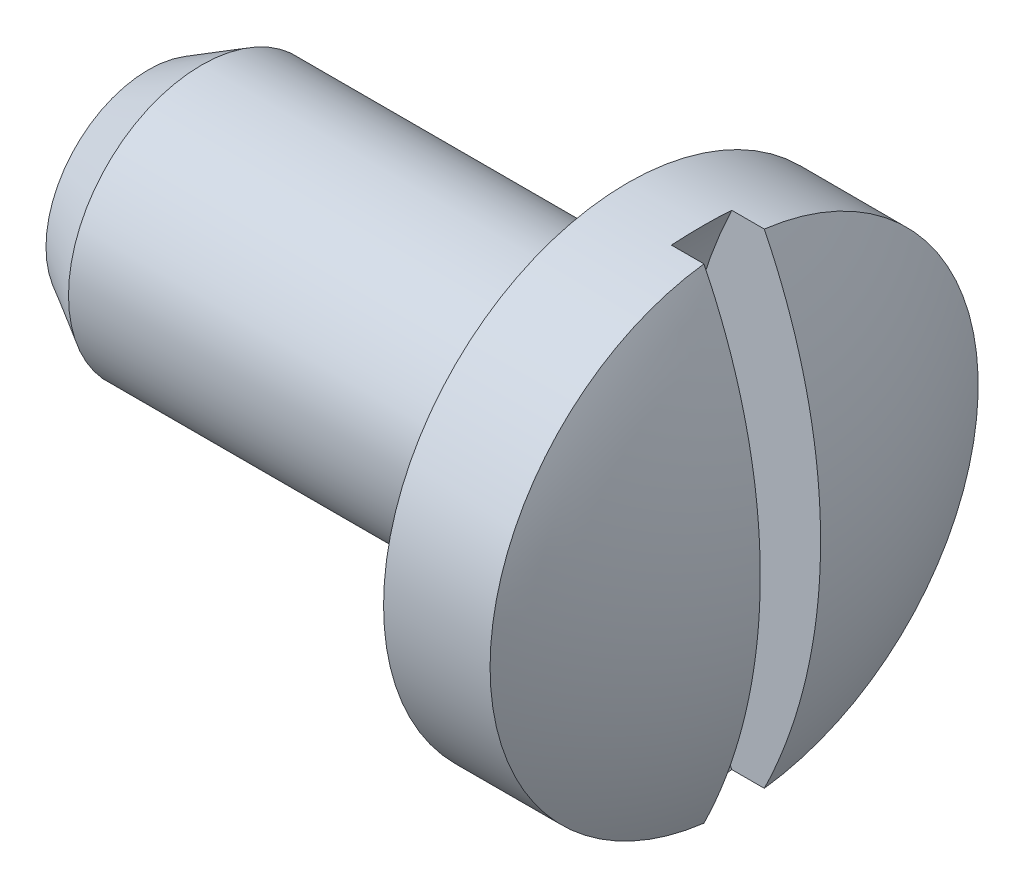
ISO-10303-21;
HEADER;
FILE_DESCRIPTION(('STEP AP214'),'2;1');
FILE_NAME('part.step','',(''),(''),'','','');
FILE_SCHEMA(('AUTOMOTIVE_DESIGN { 1 0 10303 214 1 1 1 1 }'));
ENDSEC;
DATA;
#1=APPLICATION_CONTEXT('core data for automotive mechanical design processes');
#2=APPLICATION_PROTOCOL_DEFINITION('international standard','automotive_design',2000,#1);
#3=PRODUCT_CONTEXT('',#1,'mechanical');
#4=PRODUCT('Part','Part','',(#3));
#5=PRODUCT_RELATED_PRODUCT_CATEGORY('part','',(#4));
#6=PRODUCT_DEFINITION_FORMATION('','',#4);
#7=PRODUCT_DEFINITION_CONTEXT('part definition',#1,'design');
#8=PRODUCT_DEFINITION('design','',#6,#7);
#9=PRODUCT_DEFINITION_SHAPE('','',#8);
#10=(LENGTH_UNIT() NAMED_UNIT(*) SI_UNIT(.MILLI.,.METRE.));
#11=(NAMED_UNIT(*) PLANE_ANGLE_UNIT() SI_UNIT($,.RADIAN.));
#12=(NAMED_UNIT(*) SI_UNIT($,.STERADIAN.) SOLID_ANGLE_UNIT());
#13=UNCERTAINTY_MEASURE_WITH_UNIT(LENGTH_MEASURE(1.E-05),#10,'distance_accuracy_value','');
#14=(GEOMETRIC_REPRESENTATION_CONTEXT(3) GLOBAL_UNCERTAINTY_ASSIGNED_CONTEXT((#13)) GLOBAL_UNIT_ASSIGNED_CONTEXT((#10,
#11,#12)) REPRESENTATION_CONTEXT('',''));
#15=CARTESIAN_POINT('',(0.,0.,0.));
#16=DIRECTION('',(0.,0.,1.));
#17=DIRECTION('',(1.,0.,0.));
#18=AXIS2_PLACEMENT_3D('',#15,#16,#17);
#19=CARTESIAN_POINT('',(0.,0.,0.));
#20=DIRECTION('',(-1.,0.,0.));
#21=DIRECTION('',(0.,0.,1.));
#22=AXIS2_PLACEMENT_3D('',#19,#20,#21);
#23=CYLINDRICAL_SURFACE('',#22,3.4925);
#24=CARTESIAN_POINT('',(6.858,0.,0.));
#25=DIRECTION('',(-1.,0.,0.));
#26=DIRECTION('',(0.,0.,1.));
#27=AXIS2_PLACEMENT_3D('',#24,#25,#26);
#28=CIRCLE('',#27,3.4925);
#29=CARTESIAN_POINT('',(6.858,0.,3.4925));
#30=VERTEX_POINT('',#29);
#31=EDGE_CURVE('E101',#30,#30,#28,.T.);
#32=ORIENTED_EDGE('',*,*,#31,.F.);
#33=EDGE_LOOP('',(#32));
#34=FACE_BOUND('',#33,.T.);
#35=DIRECTION('',(-1.,0.,0.));
#36=VECTOR('',#35,1.);
#37=CARTESIAN_POINT('',(0.,3.46570411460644,-0.4318));
#38=LINE('',#37,#36);
#39=CARTESIAN_POINT('',(8.382,3.46570411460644,-0.4318));
#40=VERTEX_POINT('',#39);
#41=CARTESIAN_POINT('',(7.91613510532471,3.46570411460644,-0.4318));
#42=VERTEX_POINT('',#41);
#43=EDGE_CURVE('E94',#40,#42,#38,.T.);
#44=ORIENTED_EDGE('',*,*,#43,.F.);
#45=CARTESIAN_POINT('',(8.382,0.,0.));
#46=DIRECTION('',(-1.,0.,0.));
#47=DIRECTION('',(0.,0.,1.));
#48=AXIS2_PLACEMENT_3D('',#45,#46,#47);
#49=CIRCLE('',#48,3.4925);
#50=CARTESIAN_POINT('',(8.382,-3.46570411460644,-0.4318));
#51=VERTEX_POINT('',#50);
#52=EDGE_CURVE('E100',#40,#51,#49,.T.);
#53=ORIENTED_EDGE('',*,*,#52,.T.);
#54=DIRECTION('',(-1.,0.,0.));
#55=VECTOR('',#54,1.);
#56=CARTESIAN_POINT('',(0.,-3.46570411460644,-0.4318));
#57=LINE('',#56,#55);
#58=CARTESIAN_POINT('',(7.91613510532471,-3.46570411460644,-0.4318));
#59=VERTEX_POINT('',#58);
#60=EDGE_CURVE('E92',#59,#51,#57,.F.);
#61=ORIENTED_EDGE('',*,*,#60,.F.);
#62=CARTESIAN_POINT('',(7.91613510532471,-3.46570411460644,-0.4318));
#63=CARTESIAN_POINT('',(7.92466112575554,-3.48356803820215,-0.287866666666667));
#64=CARTESIAN_POINT('',(7.92892413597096,-3.4925,-0.143933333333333));
#65=CARTESIAN_POINT('',(7.92892413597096,-3.4925,0.143933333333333));
#66=CARTESIAN_POINT('',(7.92466112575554,-3.48356803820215,0.287866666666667));
#67=CARTESIAN_POINT('',(7.91613510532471,-3.46570411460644,0.4318));
#68=B_SPLINE_CURVE_WITH_KNOTS('',3,(#62,#63,#64,#65,#66,#67),.UNSPECIFIED.,.F.,.F.,(4,2,4),(0.,
0.432819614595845,0.865639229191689),.UNSPECIFIED.);
#69=CARTESIAN_POINT('',(7.91613510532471,-3.46570411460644,0.4318));
#70=VERTEX_POINT('',#69);
#71=EDGE_CURVE('E45',#59,#70,#68,.T.);
#72=ORIENTED_EDGE('',*,*,#71,.T.);
#73=DIRECTION('',(-1.,0.,0.));
#74=VECTOR('',#73,1.);
#75=CARTESIAN_POINT('',(0.,-3.46570411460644,0.4318));
#76=LINE('',#75,#74);
#77=CARTESIAN_POINT('',(8.382,-3.46570411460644,0.4318));
#78=VERTEX_POINT('',#77);
#79=EDGE_CURVE('E87',#70,#78,#76,.F.);
#80=ORIENTED_EDGE('',*,*,#79,.T.);
#81=CARTESIAN_POINT('',(8.382,3.46570411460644,0.4318));
#82=VERTEX_POINT('',#81);
#83=EDGE_CURVE('E91',#78,#82,#49,.T.);
#84=ORIENTED_EDGE('',*,*,#83,.T.);
#85=DIRECTION('',(-1.,0.,0.));
#86=VECTOR('',#85,1.);
#87=CARTESIAN_POINT('',(0.,3.46570411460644,0.4318));
#88=LINE('',#87,#86);
#89=CARTESIAN_POINT('',(7.91613510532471,3.46570411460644,0.4318));
#90=VERTEX_POINT('',#89);
#91=EDGE_CURVE('E52',#82,#90,#88,.T.);
#92=ORIENTED_EDGE('',*,*,#91,.T.);
#93=CARTESIAN_POINT('',(7.91613510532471,3.46570411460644,0.4318));
#94=CARTESIAN_POINT('',(7.92466112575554,3.48356803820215,0.287866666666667));
#95=CARTESIAN_POINT('',(7.92892413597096,3.4925,0.143933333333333));
#96=CARTESIAN_POINT('',(7.92892413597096,3.4925,-0.143933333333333));
#97=CARTESIAN_POINT('',(7.92466112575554,3.48356803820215,-0.287866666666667));
#98=CARTESIAN_POINT('',(7.91613510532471,3.46570411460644,-0.4318));
#99=B_SPLINE_CURVE_WITH_KNOTS('',3,(#93,#94,#95,#96,#97,#98),.UNSPECIFIED.,.F.,.F.,(4,2,4),(0.,
0.432819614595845,0.865639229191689),.UNSPECIFIED.);
#100=EDGE_CURVE('E11',#90,#42,#99,.T.);
#101=ORIENTED_EDGE('',*,*,#100,.T.);
#102=EDGE_LOOP('',(#44,#53,#61,#72,#80,#84,#92,#101));
#103=FACE_BOUND('',#102,.T.);
#104=ADVANCED_FACE('F32',(#34,#103),#23,.T.);
#105=CARTESIAN_POINT('',(1.32492413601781,0.,0.));
#106=DIRECTION('',(-1.,0.,0.));
#107=DIRECTION('',(0.,1.,0.));
#108=AXIS2_PLACEMENT_3D('',#105,#106,#107);
#109=SPHERICAL_SURFACE('',#108,7.874);
#110=CARTESIAN_POINT('',(1.32492413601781,0.,-0.4318));
#111=DIRECTION('',(0.,0.,1.));
#112=DIRECTION('',(1.,0.,0.));
#113=AXIS2_PLACEMENT_3D('',#110,#111,#112);
#114=CIRCLE('',#113,7.86215140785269);
#115=EDGE_CURVE('E60',#51,#40,#114,.T.);
#116=ORIENTED_EDGE('',*,*,#115,.F.);
#117=ORIENTED_EDGE('',*,*,#52,.F.);
#118=EDGE_LOOP('',(#116,#117));
#119=FACE_BOUND('',#118,.T.);
#120=ADVANCED_FACE('F134',(#119),#109,.T.);
#121=CARTESIAN_POINT('',(0.,0.,0.));
#122=DIRECTION('',(1.,0.,0.));
#123=DIRECTION('',(0.,0.,-1.));
#124=AXIS2_PLACEMENT_3D('',#121,#122,#123);
#125=PLANE('',#124);
#126=CARTESIAN_POINT('',(0.,0.,0.));
#127=DIRECTION('',(-1.,0.,0.));
#128=DIRECTION('',(0.,0.,1.));
#129=AXIS2_PLACEMENT_3D('',#126,#127,#128);
#130=CIRCLE('',#129,1.4650590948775);
#131=CARTESIAN_POINT('',(0.,0.,1.4650590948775));
#132=VERTEX_POINT('',#131);
#133=EDGE_CURVE('E113',#132,#132,#130,.T.);
#134=ORIENTED_EDGE('',*,*,#133,.T.);
#135=EDGE_LOOP('',(#134));
#136=FACE_BOUND('',#135,.T.);
#137=ADVANCED_FACE('F34',(#136),#125,.F.);
#138=CARTESIAN_POINT('',(0.762,0.,0.));
#139=DIRECTION('',(1.,0.,0.));
#140=DIRECTION('',(0.,0.,-1.));
#141=AXIS2_PLACEMENT_3D('',#138,#139,#140);
#142=CONICAL_SURFACE('',#141,1.905,0.5235987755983);
#143=ORIENTED_EDGE('',*,*,#133,.F.);
#144=EDGE_LOOP('',(#143));
#145=FACE_BOUND('',#144,.T.);
#146=CARTESIAN_POINT('',(0.762,0.,0.));
#147=DIRECTION('',(-1.,0.,0.));
#148=DIRECTION('',(0.,0.,1.));
#149=AXIS2_PLACEMENT_3D('',#146,#147,#148);
#150=CIRCLE('',#149,1.905);
#151=CARTESIAN_POINT('',(0.762,0.,1.905));
#152=VERTEX_POINT('',#151);
#153=EDGE_CURVE('E110',#152,#152,#150,.T.);
#154=ORIENTED_EDGE('',*,*,#153,.T.);
#155=EDGE_LOOP('',(#154));
#156=FACE_BOUND('',#155,.T.);
#157=ADVANCED_FACE('F159',(#145,#156),#142,.T.);
#158=CARTESIAN_POINT('',(0.,0.,0.));
#159=DIRECTION('',(-1.,0.,0.));
#160=DIRECTION('',(0.,0.,1.));
#161=AXIS2_PLACEMENT_3D('',#158,#159,#160);
#162=CYLINDRICAL_SURFACE('',#161,1.905);
#163=ORIENTED_EDGE('',*,*,#153,.F.);
#164=EDGE_LOOP('',(#163));
#165=FACE_BOUND('',#164,.T.);
#166=CARTESIAN_POINT('',(6.604,0.,0.));
#167=DIRECTION('',(-1.,0.,0.));
#168=DIRECTION('',(0.,0.,1.));
#169=AXIS2_PLACEMENT_3D('',#166,#167,#168);
#170=CIRCLE('',#169,1.905);
#171=CARTESIAN_POINT('',(6.604,0.,1.905));
#172=VERTEX_POINT('',#171);
#173=EDGE_CURVE('E107',#172,#172,#170,.T.);
#174=ORIENTED_EDGE('',*,*,#173,.T.);
#175=EDGE_LOOP('',(#174));
#176=FACE_BOUND('',#175,.T.);
#177=ADVANCED_FACE('F166',(#165,#176),#162,.T.);
#178=CARTESIAN_POINT('',(6.604,0.,0.));
#179=DIRECTION('',(-1.,0.,0.));
#180=DIRECTION('',(0.,0.,1.));
#181=AXIS2_PLACEMENT_3D('',#178,#179,#180);
#182=TOROIDAL_SURFACE('',#181,2.159,0.254);
#183=ORIENTED_EDGE('',*,*,#173,.F.);
#184=EDGE_LOOP('',(#183));
#185=FACE_BOUND('',#184,.T.);
#186=CARTESIAN_POINT('',(6.858,0.,0.));
#187=DIRECTION('',(-1.,0.,0.));
#188=DIRECTION('',(0.,0.,1.));
#189=AXIS2_PLACEMENT_3D('',#186,#187,#188);
#190=CIRCLE('',#189,2.159);
#191=CARTESIAN_POINT('',(6.858,0.,2.159));
#192=VERTEX_POINT('',#191);
#193=EDGE_CURVE('E104',#192,#192,#190,.T.);
#194=ORIENTED_EDGE('',*,*,#193,.T.);
#195=EDGE_LOOP('',(#194));
#196=FACE_BOUND('',#195,.T.);
#197=ADVANCED_FACE('F138',(#185,#196),#182,.F.);
#198=CARTESIAN_POINT('',(6.858,2.159,0.));
#199=DIRECTION('',(1.,0.,0.));
#200=DIRECTION('',(0.,0.,-1.));
#201=AXIS2_PLACEMENT_3D('',#198,#199,#200);
#202=PLANE('',#201);
#203=ORIENTED_EDGE('',*,*,#193,.F.);
#204=EDGE_LOOP('',(#203));
#205=FACE_BOUND('',#204,.T.);
#206=ORIENTED_EDGE('',*,*,#31,.T.);
#207=EDGE_LOOP('',(#206));
#208=FACE_BOUND('',#207,.T.);
#209=ADVANCED_FACE('F132',(#205,#208),#202,.F.);
#210=ORIENTED_EDGE('',*,*,#83,.F.);
#211=CARTESIAN_POINT('',(1.32492413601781,0.,0.4318));
#212=DIRECTION('',(0.,0.,1.));
#213=DIRECTION('',(1.,0.,0.));
#214=AXIS2_PLACEMENT_3D('',#211,#212,#213);
#215=CIRCLE('',#214,7.86215140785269);
#216=EDGE_CURVE('E116',#78,#82,#215,.T.);
#217=ORIENTED_EDGE('',*,*,#216,.T.);
#218=EDGE_LOOP('',(#210,#217));
#219=FACE_BOUND('',#218,.T.);
#220=ADVANCED_FACE('F128',(#219),#109,.T.);
#221=CARTESIAN_POINT('',(15.2120281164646,0.,-0.4318));
#222=DIRECTION('',(0.,0.,1.));
#223=DIRECTION('',(1.,0.,0.));
#224=AXIS2_PLACEMENT_3D('',#221,#222,#223);
#225=CYLINDRICAL_SURFACE('',#224,8.0772);
#226=CARTESIAN_POINT('',(15.2120281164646,0.,-0.4318));
#227=DIRECTION('',(0.,0.,1.));
#228=DIRECTION('',(1.,0.,0.));
#229=AXIS2_PLACEMENT_3D('',#226,#227,#228);
#230=CIRCLE('',#229,8.0772);
#231=EDGE_CURVE('E83',#42,#59,#230,.T.);
#232=ORIENTED_EDGE('',*,*,#231,.F.);
#233=ORIENTED_EDGE('',*,*,#100,.F.);
#234=CARTESIAN_POINT('',(15.2120281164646,0.,0.4318));
#235=DIRECTION('',(0.,0.,1.));
#236=DIRECTION('',(1.,0.,0.));
#237=AXIS2_PLACEMENT_3D('',#234,#235,#236);
#238=CIRCLE('',#237,8.0772);
#239=EDGE_CURVE('E80',#90,#70,#238,.T.);
#240=ORIENTED_EDGE('',*,*,#239,.T.);
#241=ORIENTED_EDGE('',*,*,#71,.F.);
#242=EDGE_LOOP('',(#232,#233,#240,#241));
#243=FACE_BOUND('',#242,.T.);
#244=ADVANCED_FACE('F79',(#243),#225,.F.);
#245=CARTESIAN_POINT('',(15.2120281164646,0.,-0.4318));
#246=DIRECTION('',(0.,0.,1.));
#247=DIRECTION('',(1.,0.,0.));
#248=AXIS2_PLACEMENT_3D('',#245,#246,#247);
#249=PLANE('',#248);
#250=ORIENTED_EDGE('',*,*,#43,.T.);
#251=ORIENTED_EDGE('',*,*,#231,.T.);
#252=ORIENTED_EDGE('',*,*,#60,.T.);
#253=ORIENTED_EDGE('',*,*,#115,.T.);
#254=EDGE_LOOP('',(#250,#251,#252,#253));
#255=FACE_BOUND('',#254,.T.);
#256=ADVANCED_FACE('F127',(#255),#249,.T.);
#257=CARTESIAN_POINT('',(15.2120281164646,0.,0.4318));
#258=DIRECTION('',(0.,0.,1.));
#259=DIRECTION('',(1.,0.,0.));
#260=AXIS2_PLACEMENT_3D('',#257,#258,#259);
#261=PLANE('',#260);
#262=ORIENTED_EDGE('',*,*,#216,.F.);
#263=ORIENTED_EDGE('',*,*,#79,.F.);
#264=ORIENTED_EDGE('',*,*,#239,.F.);
#265=ORIENTED_EDGE('',*,*,#91,.F.);
#266=EDGE_LOOP('',(#262,#263,#264,#265));
#267=FACE_BOUND('',#266,.T.);
#268=ADVANCED_FACE('F85',(#267),#261,.F.);
#269=CLOSED_SHELL('',(#104,#120,#137,#157,#177,#197,#209,#220,#244,#256,#268));
#270=MANIFOLD_SOLID_BREP('B2',#269);
#271=ADVANCED_BREP_SHAPE_REPRESENTATION('',(#18,#270),#14);
#272=SHAPE_DEFINITION_REPRESENTATION(#9,#271);
ENDSEC;
END-ISO-10303-21;
